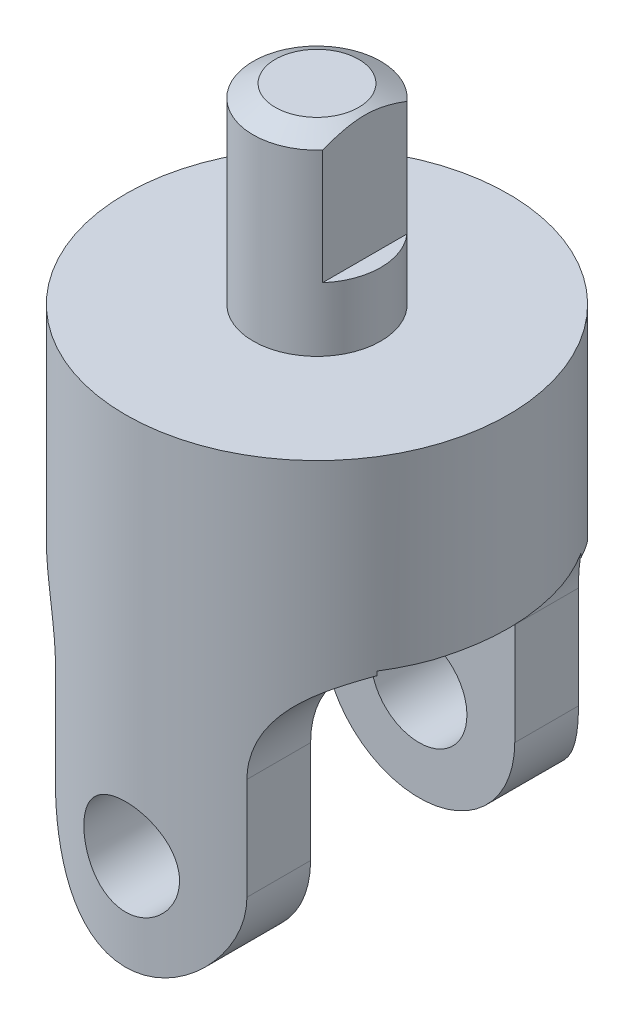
from build123d import *

# Parameters (mm, degrees)
SKETCH1_R               = 19.05
BASE_EXTRUDE_DEPTH      = 47.625
CUT_EXTRUDE1_DEPTH      = 55.716959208
CUT_EXTRUDE1_DEPTH_BACK = 55.716959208
CUT_EXTRUDE5_DEPTH      = 47.625
CUT_EXTRUDE5_DEPTH_BACK = 55.716959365
SKETCH8_W               = 20.32
SKETCH8_H               = 36.600526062
CUT_EXTRUDE6_DEPTH      = 55.716959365
CUT_EXTRUDE6_DEPTH_BACK = 55.716959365
SKETCH11_R              = 4.7625
SKETCH12_R              = 6.35
BOSS_EXTRUDE1_DEPTH     = 19.05
CHAMFER3_SIZE           = 1.27
CHAMFER3_SIZE2          = 2.199704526
CUT_EXTRUDE7_START      = -12.7
CUT_EXTRUDE7_DEPTH      = 12.7


with BuildPart() as part:
    # Sketch1 → Base-Extrude (new body)
    with BuildSketch(Plane(origin=(0, 0, 0), x_dir=(-1, 0, 0), z_dir=(0, 1, 0))):
        with Locations(Location((0, 0, 0), (0, 0, 90))):
            Circle(SKETCH1_R)
    extrude(amount=BASE_EXTRUDE_DEPTH)

    # Sketch2 → Cut-Extrude1 (cut, two sides: drawn at the far end of the back side and taken through both)
    with BuildSketch(Plane.XY.offset(-CUT_EXTRUDE1_DEPTH_BACK)):
        with BuildLine():
            Line((9.525, 9.525), (9.525, 19.685))
            ThreePointArc((9.525, 19.685), (12.314807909, 26.420192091), (19.05, 29.21))
            Line((19.05, 29.21), (19.05, -1.366191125))
            Line((19.05, -1.366191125), (-19.05, -1.366191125))
            Line((-19.05, -1.366191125), (-19.05, 29.21))
            ThreePointArc((-19.05, 29.21), (-12.314807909, 26.420192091), (-9.525, 19.685))
            Line((-9.525, 19.685), (-9.525, 9.525))
            ThreePointArc((-9.525, 9.525), (0, 0), (9.525, 9.525))
        make_face()
    extrude(amount=CUT_EXTRUDE1_DEPTH + CUT_EXTRUDE1_DEPTH_BACK, mode=Mode.SUBTRACT)

    # Sketch8 → Cut-Extrude5 (cut, two sides: drawn at the far end of the back side and taken through both)
    with BuildSketch(Plane(origin=(0, 0, 0), x_dir=(0, 0, -1), z_dir=(1, 0, 0)).offset(-CUT_EXTRUDE5_DEPTH_BACK)):
        with Locations((0, 10.844975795)):
            Rectangle(SKETCH8_W, SKETCH8_H)
    extrude(amount=CUT_EXTRUDE5_DEPTH + CUT_EXTRUDE5_DEPTH_BACK, mode=Mode.SUBTRACT)

    # Sketch11 → Cut-Extrude6 (cut, two sides: drawn at the far end of the back side and taken through both)
    with BuildSketch(Plane.XY.offset(-CUT_EXTRUDE6_DEPTH_BACK)):
        with Locations(Location((0, 9.525, 0), (0, 0, 270))):
            Circle(SKETCH11_R)
    extrude(amount=CUT_EXTRUDE6_DEPTH + CUT_EXTRUDE6_DEPTH_BACK, mode=Mode.SUBTRACT)

    # Sketch12 → Boss-Extrude1 (add)
    with BuildSketch(Plane(origin=(0, 47.625, 0), x_dir=(-1, 0, 0), z_dir=(0, 1, 0))):
        with Locations(Location((0, 0, 0), (0, 0, 270))):
            Circle(SKETCH12_R)
    extrude(amount=BOSS_EXTRUDE1_DEPTH)

    # Chamfer3
    chamfer3_edges = [part.edges().sort_by_distance(p)[0] for p in [
        (0, 66.675, 6.35),
    ]]
    chamfer3_side = [part.faces().sort_by_distance(p)[0] for p in [
        (0, 57.15, 6.35),
    ]]
    chamfer(chamfer3_edges, length=CHAMFER3_SIZE, length2=CHAMFER3_SIZE2, reference=chamfer3_side[0])

    # Sketch13 → Cut-Extrude7 (cut)
    with BuildSketch(Plane(origin=(0, 66.675, 0), x_dir=(-1, 0, 0), z_dir=(0, 1, 0)).offset(CUT_EXTRUDE7_START)):
        with BuildLine():
            Line((-4.7625, 4.200130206), (-4.7625, -4.200130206))
            ThreePointArc((-4.7625, -4.200130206), (-6.35, 0), (-4.7625, 4.200130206))
        make_face()
    extrude(amount=CUT_EXTRUDE7_DEPTH, mode=Mode.SUBTRACT)


solid = part.part
